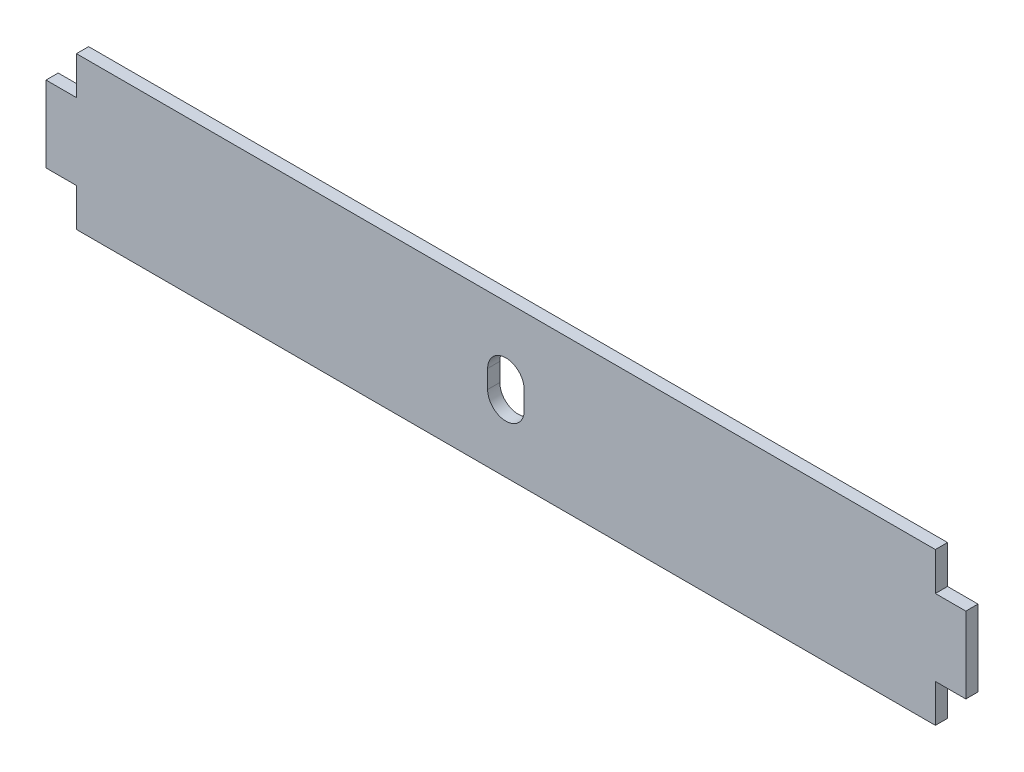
from build123d import *

# Parameters (mm, degrees)
BOSS_EXTRUDE1_DEPTH = 4


with BuildPart() as part:
    # Sketch1 → Boss-Extrude1 (new body)
    with BuildSketch(Plane.XY):
        with BuildLine():
            Line((141, -12.5), (141, -25))
            Line((141, -25), (0, -25))
            Line((0, -25), (0, -9))
            ThreePointArc((0, -9), (4.242640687, -7.242640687), (6, -3))
            Line((6, -3), (6, 3))
            ThreePointArc((6, 3), (4.242640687, 7.242640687), (0, 9))
            Line((0, 9), (0, 25))
            Line((0, 25), (141, 25))
            Line((141, 25), (141, 12.5))
            Line((141, 12.5), (151, 12.5))
            Line((151, 12.5), (151, -12.5))
            Line((151, -12.5), (141, -12.5))
        make_face()
    boss_extrude1 = extrude(amount=BOSS_EXTRUDE1_DEPTH)

    # Mirror1: Boss-Extrude1 across plane
    add(boss_extrude1.mirror(Plane(origin=(0, 0, 0), x_dir=(0, 0, 1), z_dir=(1, 0, 0))))


solid = part.part
